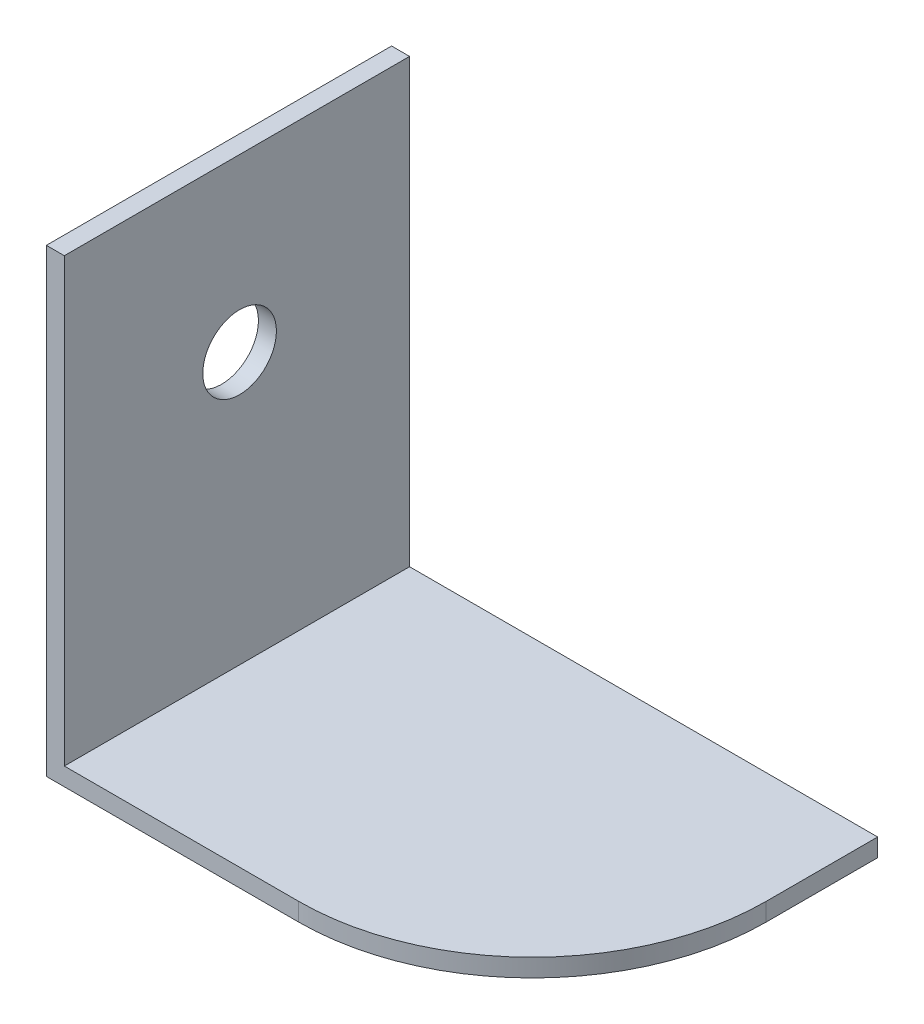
from build123d import *

# Parameters (mm, degrees)
EXTRUDE_THIN1_DEPTH = 48.768
SKETCH2_R           = 5.199803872
CUT_EXTRUDE1_DEPTH  = 105.746469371
FILLET1_R           = 33.02


with BuildPart() as part:
    # Sketch1 → Extrude-Thin1 (new body)
    with BuildSketch(Plane.XY):
        Polygon((0, 64.97343934), (0, 0), (68.660777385, 0), (68.660777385, 2.54), (2.54, 2.54), (2.54, 64.97343934), align=None)
    extrude(amount=EXTRUDE_THIN1_DEPTH)

    # Sketch2 → Cut-Extrude1 (cut, through all)
    with BuildSketch(Plane(origin=(2.54, 0, 0), x_dir=(0, 0, -1), z_dir=(1, 0, 0))):
        with Locations((-24.011734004, 40.793838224)):
            Circle(SKETCH2_R)
    extrude(amount=-CUT_EXTRUDE1_DEPTH, mode=Mode.SUBTRACT)

    # Fillet1
    fillet1_edges = [part.edges().sort_by_distance(p)[0] for p in [
        (68.660777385, 1.27, 48.768),
    ]]
    fillet(fillet1_edges, radius=FILLET1_R)


solid = part.part
